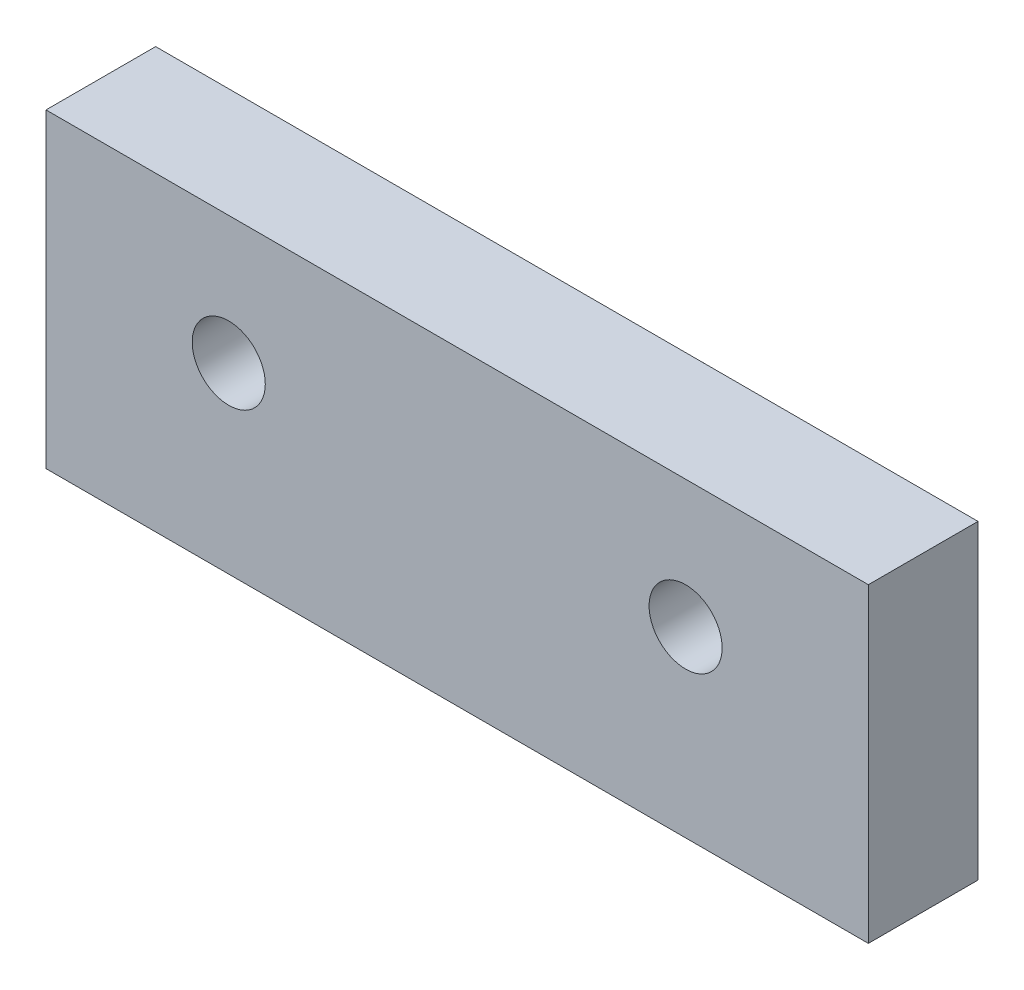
ISO-10303-21;
HEADER;
FILE_DESCRIPTION(('STEP AP214'),'2;1');
FILE_NAME('part.step','',(''),(''),'','','');
FILE_SCHEMA(('AUTOMOTIVE_DESIGN { 1 0 10303 214 1 1 1 1 }'));
ENDSEC;
DATA;
#1=APPLICATION_CONTEXT('core data for automotive mechanical design processes');
#2=APPLICATION_PROTOCOL_DEFINITION('international standard','automotive_design',2000,#1);
#3=PRODUCT_CONTEXT('',#1,'mechanical');
#4=PRODUCT('Part','Part','',(#3));
#5=PRODUCT_RELATED_PRODUCT_CATEGORY('part','',(#4));
#6=PRODUCT_DEFINITION_FORMATION('','',#4);
#7=PRODUCT_DEFINITION_CONTEXT('part definition',#1,'design');
#8=PRODUCT_DEFINITION('design','',#6,#7);
#9=PRODUCT_DEFINITION_SHAPE('','',#8);
#10=(LENGTH_UNIT() NAMED_UNIT(*) SI_UNIT(.MILLI.,.METRE.));
#11=(NAMED_UNIT(*) PLANE_ANGLE_UNIT() SI_UNIT($,.RADIAN.));
#12=(NAMED_UNIT(*) SI_UNIT($,.STERADIAN.) SOLID_ANGLE_UNIT());
#13=UNCERTAINTY_MEASURE_WITH_UNIT(LENGTH_MEASURE(1.E-05),#10,'distance_accuracy_value','');
#14=(GEOMETRIC_REPRESENTATION_CONTEXT(3) GLOBAL_UNCERTAINTY_ASSIGNED_CONTEXT((#13)) GLOBAL_UNIT_ASSIGNED_CONTEXT((#10,
#11,#12)) REPRESENTATION_CONTEXT('',''));
#15=CARTESIAN_POINT('',(0.,0.,0.));
#16=DIRECTION('',(0.,0.,1.));
#17=DIRECTION('',(1.,0.,0.));
#18=AXIS2_PLACEMENT_3D('',#15,#16,#17);
#19=CARTESIAN_POINT('',(0.,0.,6.));
#20=DIRECTION('',(0.,0.,1.));
#21=DIRECTION('',(1.,0.,0.));
#22=AXIS2_PLACEMENT_3D('',#19,#20,#21);
#23=PLANE('',#22);
#24=DIRECTION('',(0.,1.,0.));
#25=VECTOR('',#24,1.);
#26=CARTESIAN_POINT('',(22.5,8.5,6.));
#27=LINE('',#26,#25);
#28=CARTESIAN_POINT('',(22.5,-8.5,6.));
#29=VERTEX_POINT('',#28);
#30=CARTESIAN_POINT('',(22.5,8.5,6.));
#31=VERTEX_POINT('',#30);
#32=EDGE_CURVE('E85',#29,#31,#27,.T.);
#33=ORIENTED_EDGE('',*,*,#32,.T.);
#34=DIRECTION('',(-1.,0.,0.));
#35=VECTOR('',#34,1.);
#36=CARTESIAN_POINT('',(-22.5,8.5,6.));
#37=LINE('',#36,#35);
#38=CARTESIAN_POINT('',(-22.5,8.5,6.));
#39=VERTEX_POINT('',#38);
#40=EDGE_CURVE('E80',#31,#39,#37,.T.);
#41=ORIENTED_EDGE('',*,*,#40,.T.);
#42=DIRECTION('',(0.,-1.,0.));
#43=VECTOR('',#42,1.);
#44=CARTESIAN_POINT('',(-22.5,8.5,6.));
#45=LINE('',#44,#43);
#46=CARTESIAN_POINT('',(-22.5,-8.5,6.));
#47=VERTEX_POINT('',#46);
#48=EDGE_CURVE('E83',#39,#47,#45,.T.);
#49=ORIENTED_EDGE('',*,*,#48,.T.);
#50=DIRECTION('',(1.,0.,0.));
#51=VECTOR('',#50,1.);
#52=CARTESIAN_POINT('',(-22.5,-8.5,6.));
#53=LINE('',#52,#51);
#54=EDGE_CURVE('E50',#47,#29,#53,.T.);
#55=ORIENTED_EDGE('',*,*,#54,.T.);
#56=EDGE_LOOP('',(#33,#41,#49,#55));
#57=FACE_BOUND('',#56,.T.);
#58=CARTESIAN_POINT('',(-12.5,1.5,6.));
#59=DIRECTION('',(0.,0.,1.));
#60=DIRECTION('',(1.,0.,0.));
#61=AXIS2_PLACEMENT_3D('',#58,#59,#60);
#62=CIRCLE('',#61,2.);
#63=CARTESIAN_POINT('',(-10.5,1.5,6.));
#64=VERTEX_POINT('',#63);
#65=EDGE_CURVE('E112',#64,#64,#62,.T.);
#66=ORIENTED_EDGE('',*,*,#65,.F.);
#67=EDGE_LOOP('',(#66));
#68=FACE_BOUND('',#67,.T.);
#69=CARTESIAN_POINT('',(12.5,1.5,6.));
#70=DIRECTION('',(0.,0.,-1.));
#71=DIRECTION('',(-1.,0.,0.));
#72=AXIS2_PLACEMENT_3D('',#69,#70,#71);
#73=CIRCLE('',#72,2.);
#74=CARTESIAN_POINT('',(10.5,1.5,6.));
#75=VERTEX_POINT('',#74);
#76=EDGE_CURVE('E118',#75,#75,#73,.T.);
#77=ORIENTED_EDGE('',*,*,#76,.T.);
#78=EDGE_LOOP('',(#77));
#79=FACE_BOUND('',#78,.T.);
#80=ADVANCED_FACE('F33',(#57,#68,#79),#23,.T.);
#81=CARTESIAN_POINT('',(0.,0.,0.));
#82=DIRECTION('',(0.,0.,1.));
#83=DIRECTION('',(1.,0.,0.));
#84=AXIS2_PLACEMENT_3D('',#81,#82,#83);
#85=PLANE('',#84);
#86=DIRECTION('',(0.,1.,0.));
#87=VECTOR('',#86,1.);
#88=CARTESIAN_POINT('',(22.5,8.5,0.));
#89=LINE('',#88,#87);
#90=CARTESIAN_POINT('',(22.5,-8.5,0.));
#91=VERTEX_POINT('',#90);
#92=CARTESIAN_POINT('',(22.5,8.5,0.));
#93=VERTEX_POINT('',#92);
#94=EDGE_CURVE('E97',#91,#93,#89,.T.);
#95=ORIENTED_EDGE('',*,*,#94,.F.);
#96=DIRECTION('',(1.,0.,0.));
#97=VECTOR('',#96,1.);
#98=CARTESIAN_POINT('',(-22.5,-8.5,0.));
#99=LINE('',#98,#97);
#100=CARTESIAN_POINT('',(-22.5,-8.5,0.));
#101=VERTEX_POINT('',#100);
#102=EDGE_CURVE('E73',#101,#91,#99,.T.);
#103=ORIENTED_EDGE('',*,*,#102,.F.);
#104=DIRECTION('',(0.,-1.,0.));
#105=VECTOR('',#104,1.);
#106=CARTESIAN_POINT('',(-22.5,8.5,0.));
#107=LINE('',#106,#105);
#108=CARTESIAN_POINT('',(-22.5,8.5,0.));
#109=VERTEX_POINT('',#108);
#110=EDGE_CURVE('E67',#109,#101,#107,.T.);
#111=ORIENTED_EDGE('',*,*,#110,.F.);
#112=DIRECTION('',(-1.,0.,0.));
#113=VECTOR('',#112,1.);
#114=CARTESIAN_POINT('',(-22.5,8.5,0.));
#115=LINE('',#114,#113);
#116=EDGE_CURVE('E89',#93,#109,#115,.T.);
#117=ORIENTED_EDGE('',*,*,#116,.F.);
#118=EDGE_LOOP('',(#95,#103,#111,#117));
#119=FACE_BOUND('',#118,.T.);
#120=CARTESIAN_POINT('',(-12.5,1.5,0.));
#121=DIRECTION('',(0.,0.,1.));
#122=DIRECTION('',(1.,0.,0.));
#123=AXIS2_PLACEMENT_3D('',#120,#121,#122);
#124=CIRCLE('',#123,2.);
#125=CARTESIAN_POINT('',(-10.5,1.5,0.));
#126=VERTEX_POINT('',#125);
#127=EDGE_CURVE('E100',#126,#126,#124,.T.);
#128=ORIENTED_EDGE('',*,*,#127,.T.);
#129=EDGE_LOOP('',(#128));
#130=FACE_BOUND('',#129,.T.);
#131=CARTESIAN_POINT('',(12.5,1.5,0.));
#132=DIRECTION('',(0.,0.,-1.));
#133=DIRECTION('',(-1.,0.,0.));
#134=AXIS2_PLACEMENT_3D('',#131,#132,#133);
#135=CIRCLE('',#134,2.);
#136=CARTESIAN_POINT('',(10.5,1.5,0.));
#137=VERTEX_POINT('',#136);
#138=EDGE_CURVE('E115',#137,#137,#135,.T.);
#139=ORIENTED_EDGE('',*,*,#138,.F.);
#140=EDGE_LOOP('',(#139));
#141=FACE_BOUND('',#140,.T.);
#142=ADVANCED_FACE('F108',(#119,#130,#141),#85,.F.);
#143=CARTESIAN_POINT('',(22.5,8.5,6.));
#144=DIRECTION('',(-1.,0.,0.));
#145=DIRECTION('',(0.,-1.,0.));
#146=AXIS2_PLACEMENT_3D('',#143,#144,#145);
#147=PLANE('',#146);
#148=ORIENTED_EDGE('',*,*,#94,.T.);
#149=DIRECTION('',(0.,0.,-1.));
#150=VECTOR('',#149,1.);
#151=CARTESIAN_POINT('',(22.5,8.5,6.));
#152=LINE('',#151,#150);
#153=EDGE_CURVE('E11',#31,#93,#152,.T.);
#154=ORIENTED_EDGE('',*,*,#153,.F.);
#155=ORIENTED_EDGE('',*,*,#32,.F.);
#156=DIRECTION('',(0.,0.,-1.));
#157=VECTOR('',#156,1.);
#158=CARTESIAN_POINT('',(22.5,-8.5,6.));
#159=LINE('',#158,#157);
#160=EDGE_CURVE('E93',#29,#91,#159,.T.);
#161=ORIENTED_EDGE('',*,*,#160,.T.);
#162=EDGE_LOOP('',(#148,#154,#155,#161));
#163=FACE_BOUND('',#162,.T.);
#164=ADVANCED_FACE('F35',(#163),#147,.F.);
#165=CARTESIAN_POINT('',(-22.5,8.5,6.));
#166=DIRECTION('',(0.,-1.,0.));
#167=DIRECTION('',(0.,0.,-1.));
#168=AXIS2_PLACEMENT_3D('',#165,#166,#167);
#169=PLANE('',#168);
#170=ORIENTED_EDGE('',*,*,#116,.T.);
#171=DIRECTION('',(0.,0.,-1.));
#172=VECTOR('',#171,1.);
#173=CARTESIAN_POINT('',(-22.5,8.5,6.));
#174=LINE('',#173,#172);
#175=EDGE_CURVE('E42',#39,#109,#174,.T.);
#176=ORIENTED_EDGE('',*,*,#175,.F.);
#177=ORIENTED_EDGE('',*,*,#40,.F.);
#178=ORIENTED_EDGE('',*,*,#153,.T.);
#179=EDGE_LOOP('',(#170,#176,#177,#178));
#180=FACE_BOUND('',#179,.T.);
#181=ADVANCED_FACE('F88',(#180),#169,.F.);
#182=CARTESIAN_POINT('',(-22.5,8.5,6.));
#183=DIRECTION('',(1.,0.,0.));
#184=DIRECTION('',(0.,1.,0.));
#185=AXIS2_PLACEMENT_3D('',#182,#183,#184);
#186=PLANE('',#185);
#187=ORIENTED_EDGE('',*,*,#110,.T.);
#188=DIRECTION('',(0.,0.,-1.));
#189=VECTOR('',#188,1.);
#190=CARTESIAN_POINT('',(-22.5,-8.5,6.));
#191=LINE('',#190,#189);
#192=EDGE_CURVE('E90',#47,#101,#191,.T.);
#193=ORIENTED_EDGE('',*,*,#192,.F.);
#194=ORIENTED_EDGE('',*,*,#48,.F.);
#195=ORIENTED_EDGE('',*,*,#175,.T.);
#196=EDGE_LOOP('',(#187,#193,#194,#195));
#197=FACE_BOUND('',#196,.T.);
#198=ADVANCED_FACE('F91',(#197),#186,.F.);
#199=CARTESIAN_POINT('',(-22.5,-8.5,6.));
#200=DIRECTION('',(0.,1.,0.));
#201=DIRECTION('',(0.,0.,1.));
#202=AXIS2_PLACEMENT_3D('',#199,#200,#201);
#203=PLANE('',#202);
#204=ORIENTED_EDGE('',*,*,#102,.T.);
#205=ORIENTED_EDGE('',*,*,#160,.F.);
#206=ORIENTED_EDGE('',*,*,#54,.F.);
#207=ORIENTED_EDGE('',*,*,#192,.T.);
#208=EDGE_LOOP('',(#204,#205,#206,#207));
#209=FACE_BOUND('',#208,.T.);
#210=ADVANCED_FACE('F105',(#209),#203,.F.);
#211=CARTESIAN_POINT('',(-12.5,1.5,0.));
#212=DIRECTION('',(0.,0.,1.));
#213=DIRECTION('',(1.,0.,0.));
#214=AXIS2_PLACEMENT_3D('',#211,#212,#213);
#215=CYLINDRICAL_SURFACE('',#214,2.);
#216=ORIENTED_EDGE('',*,*,#127,.F.);
#217=EDGE_LOOP('',(#216));
#218=FACE_BOUND('',#217,.T.);
#219=ORIENTED_EDGE('',*,*,#65,.T.);
#220=EDGE_LOOP('',(#219));
#221=FACE_BOUND('',#220,.T.);
#222=ADVANCED_FACE('F138',(#218,#221),#215,.F.);
#223=CARTESIAN_POINT('',(12.5,1.5,0.));
#224=DIRECTION('',(0.,0.,1.));
#225=DIRECTION('',(1.,0.,0.));
#226=AXIS2_PLACEMENT_3D('',#223,#224,#225);
#227=CYLINDRICAL_SURFACE('',#226,2.);
#228=ORIENTED_EDGE('',*,*,#138,.T.);
#229=EDGE_LOOP('',(#228));
#230=FACE_BOUND('',#229,.T.);
#231=ORIENTED_EDGE('',*,*,#76,.F.);
#232=EDGE_LOOP('',(#231));
#233=FACE_BOUND('',#232,.T.);
#234=ADVANCED_FACE('F124',(#230,#233),#227,.F.);
#235=CLOSED_SHELL('',(#80,#142,#164,#181,#198,#210,#222,#234));
#236=MANIFOLD_SOLID_BREP('B2',#235);
#237=ADVANCED_BREP_SHAPE_REPRESENTATION('',(#18,#236),#14);
#238=SHAPE_DEFINITION_REPRESENTATION(#9,#237);
ENDSEC;
END-ISO-10303-21;
